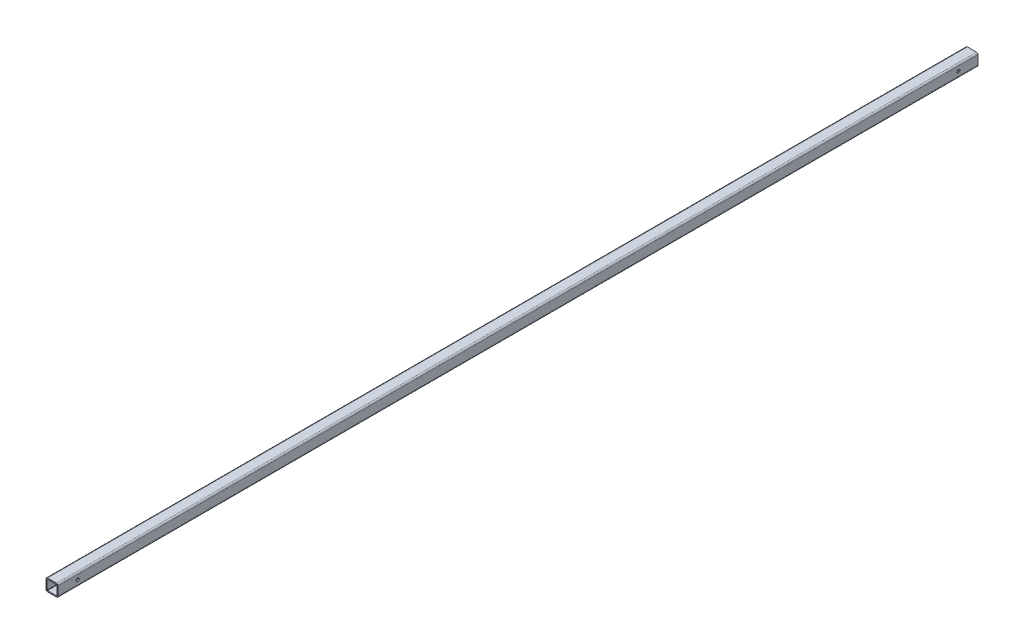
from build123d import *

# Parameters (mm, degrees)
BOSS_EXTRU_1_DEPTH      = 1220
ESQUISSE2_R             = 2
ENL_V_MAT_EXTRU_1_DEPTH = 1221.131140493


with BuildPart() as part:
    # Esquisse1 → Boss.-Extru.1 (new body)
    with BuildSketch(Plane.XY):
        with BuildLine():
            Line((-6, 8), (6, 8))
            ThreePointArc((6, 8), (7.414213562, 7.414213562), (8, 6))
            Line((8, 6), (8, -6))
            ThreePointArc((8, -6), (7.414213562, -7.414213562), (6, -8))
            Line((6, -8), (-6, -8))
            ThreePointArc((-6, -8), (-7.414213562, -7.414213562), (-8, -6))
            Line((-8, -6), (-8, 6))
            ThreePointArc((-8, 6), (-7.414213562, 7.414213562), (-6, 8))
        make_face()
        with BuildLine():
            Line((-6.5, 6), (-6.5, -6))
            ThreePointArc((-6.5, -6), (-6.353553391, -6.353553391), (-6, -6.5))
            Line((-6, -6.5), (6, -6.5))
            ThreePointArc((6, -6.5), (6.353553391, -6.353553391), (6.5, -6))
            Line((6.5, -6), (6.5, 6))
            ThreePointArc((6.5, 6), (6.353553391, 6.353553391), (6, 6.5))
            Line((6, 6.5), (-6, 6.5))
            ThreePointArc((-6, 6.5), (-6.353553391, 6.353553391), (-6.5, 6))
        make_face(mode=Mode.SUBTRACT)
    extrude(amount=BOSS_EXTRU_1_DEPTH)

    # Esquisse2 → Enl_v. mat.-Extru.1 (cut, through all)
    with BuildSketch(Plane(origin=(8, 0, 0), x_dir=(0, 0, -1), z_dir=(1, 0, 0))):
        with Locations(Location((-1194, 0, 0), (0, 0, 90))):
            Circle(ESQUISSE2_R)
        with Locations(Location((-26, 0, 0), (0, 0, 90))):
            Circle(ESQUISSE2_R)
    extrude(amount=-ENL_V_MAT_EXTRU_1_DEPTH, mode=Mode.SUBTRACT)


solid = part.part
